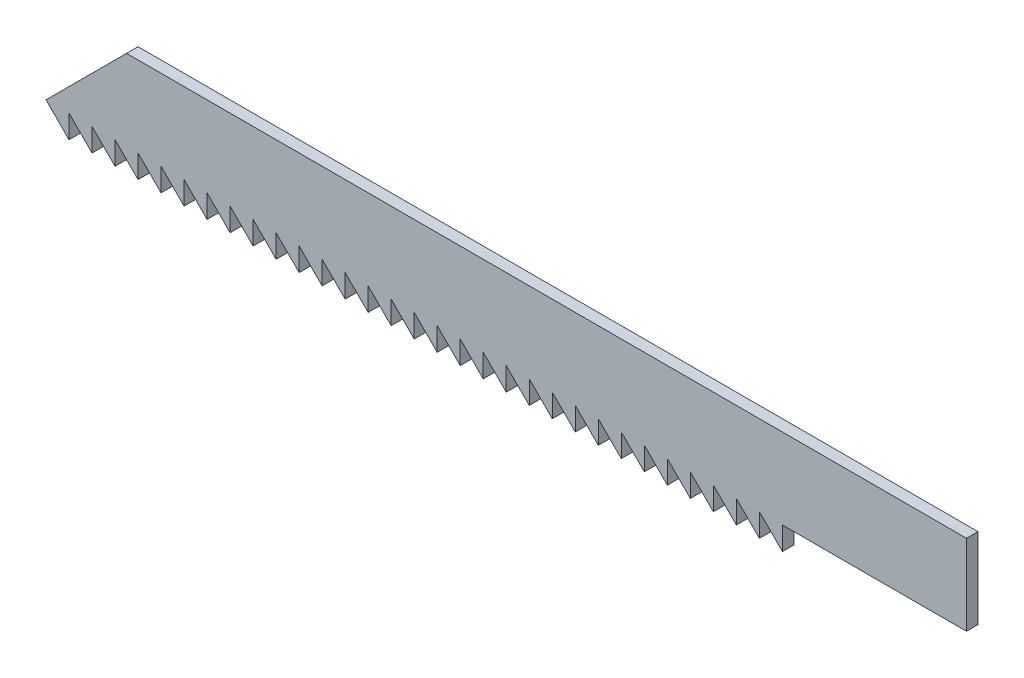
from build123d import *

# Parameters (mm, degrees)
BASE_EXTRUSION_DEPTH       = 1
BOSS_EXTRU_1_DEPTH         = 1
R_P_TITION_LIN_AIRE1_COUNT = 32
R_P_TITION_LIN_AIRE1_PITCH = 2


with BuildPart() as part:
    # Esquisse1 → Base-Extrusion (new body)
    with BuildSketch(Plane.XY):
        Polygon((-40, 0), (-33, 7), (40, 7), (40, 0), align=None)
    extrude(amount=BASE_EXTRUSION_DEPTH)

    # Esquisse2 → Boss.-Extru.1 (add)
    with BuildSketch(Plane.XY.offset(1)):
        Polygon((-40, 0), (-38, 0), (-38, -2), align=None)
    boss_extru_1 = extrude(amount=-BOSS_EXTRU_1_DEPTH)

    # R_p_tition lin_aire1: Boss.-Extru.1 ×32
    with Locations(*[(i * R_P_TITION_LIN_AIRE1_PITCH, 0, 0) for i in range(1, R_P_TITION_LIN_AIRE1_COUNT)]):
        add(boss_extru_1)


solid = part.part
